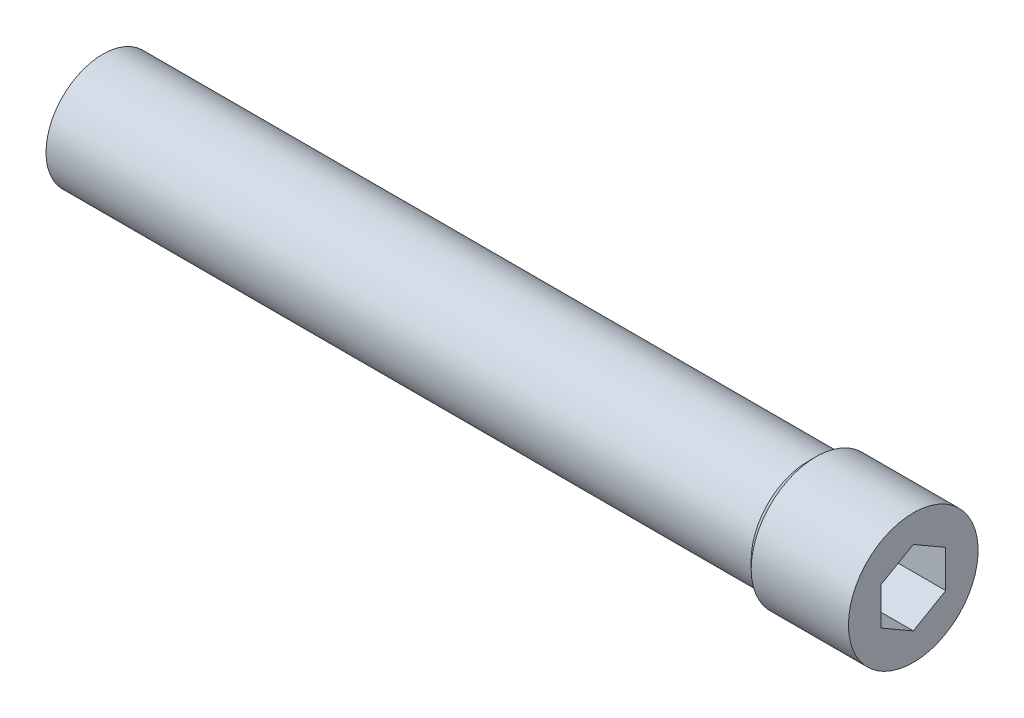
ISO-10303-21;
HEADER;
FILE_DESCRIPTION(('STEP AP214'),'2;1');
FILE_NAME('part.step','',(''),(''),'','','');
FILE_SCHEMA(('AUTOMOTIVE_DESIGN { 1 0 10303 214 1 1 1 1 }'));
ENDSEC;
DATA;
#1=APPLICATION_CONTEXT('core data for automotive mechanical design processes');
#2=APPLICATION_PROTOCOL_DEFINITION('international standard','automotive_design',2000,#1);
#3=PRODUCT_CONTEXT('',#1,'mechanical');
#4=PRODUCT('Part','Part','',(#3));
#5=PRODUCT_RELATED_PRODUCT_CATEGORY('part','',(#4));
#6=PRODUCT_DEFINITION_FORMATION('','',#4);
#7=PRODUCT_DEFINITION_CONTEXT('part definition',#1,'design');
#8=PRODUCT_DEFINITION('design','',#6,#7);
#9=PRODUCT_DEFINITION_SHAPE('','',#8);
#10=(LENGTH_UNIT() NAMED_UNIT(*) SI_UNIT(.MILLI.,.METRE.));
#11=(NAMED_UNIT(*) PLANE_ANGLE_UNIT() SI_UNIT($,.RADIAN.));
#12=(NAMED_UNIT(*) SI_UNIT($,.STERADIAN.) SOLID_ANGLE_UNIT());
#13=UNCERTAINTY_MEASURE_WITH_UNIT(LENGTH_MEASURE(1.E-05),#10,'distance_accuracy_value','');
#14=(GEOMETRIC_REPRESENTATION_CONTEXT(3) GLOBAL_UNCERTAINTY_ASSIGNED_CONTEXT((#13)) GLOBAL_UNIT_ASSIGNED_CONTEXT((#10,
#11,#12)) REPRESENTATION_CONTEXT('',''));
#15=CARTESIAN_POINT('',(0.,0.,0.));
#16=DIRECTION('',(0.,0.,1.));
#17=DIRECTION('',(1.,0.,0.));
#18=AXIS2_PLACEMENT_3D('',#15,#16,#17);
#19=CARTESIAN_POINT('',(0.,0.,0.));
#20=DIRECTION('',(1.,0.,0.));
#21=DIRECTION('',(0.,0.,-1.));
#22=AXIS2_PLACEMENT_3D('',#19,#20,#21);
#23=PLANE('',#22);
#24=CARTESIAN_POINT('',(0.,0.,0.));
#25=DIRECTION('',(-1.,0.,0.));
#26=DIRECTION('',(0.,0.,1.));
#27=AXIS2_PLACEMENT_3D('',#24,#25,#26);
#28=CIRCLE('',#27,7.);
#29=CARTESIAN_POINT('',(0.,0.,7.));
#30=VERTEX_POINT('',#29);
#31=EDGE_CURVE('E10',#30,#30,#28,.T.);
#32=ORIENTED_EDGE('',*,*,#31,.T.);
#33=EDGE_LOOP('',(#32));
#34=FACE_BOUND('',#33,.T.);
#35=ADVANCED_FACE('F16',(#34),#23,.F.);
#36=CARTESIAN_POINT('',(0.,0.,0.));
#37=DIRECTION('',(-1.,0.,0.));
#38=DIRECTION('',(0.,0.,1.));
#39=AXIS2_PLACEMENT_3D('',#36,#37,#38);
#40=CYLINDRICAL_SURFACE('',#39,7.);
#41=ORIENTED_EDGE('',*,*,#31,.F.);
#42=EDGE_LOOP('',(#41));
#43=FACE_BOUND('',#42,.T.);
#44=CARTESIAN_POINT('',(87.,0.,0.));
#45=DIRECTION('',(-1.,0.,0.));
#46=DIRECTION('',(0.,0.,1.));
#47=AXIS2_PLACEMENT_3D('',#44,#45,#46);
#48=CIRCLE('',#47,7.);
#49=CARTESIAN_POINT('',(87.,0.,7.));
#50=VERTEX_POINT('',#49);
#51=EDGE_CURVE('E23',#50,#50,#48,.T.);
#52=ORIENTED_EDGE('',*,*,#51,.T.);
#53=EDGE_LOOP('',(#52));
#54=FACE_BOUND('',#53,.T.);
#55=ADVANCED_FACE('F130',(#43,#54),#40,.T.);
#56=CARTESIAN_POINT('',(88.,0.,0.));
#57=DIRECTION('',(1.,0.,0.));
#58=DIRECTION('',(0.,0.,-1.));
#59=AXIS2_PLACEMENT_3D('',#56,#57,#58);
#60=CONICAL_SURFACE('',#59,8.,0.785398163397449);
#61=ORIENTED_EDGE('',*,*,#51,.F.);
#62=EDGE_LOOP('',(#61));
#63=FACE_BOUND('',#62,.T.);
#64=CARTESIAN_POINT('',(88.,0.,0.));
#65=DIRECTION('',(-1.,0.,0.));
#66=DIRECTION('',(0.,0.,1.));
#67=AXIS2_PLACEMENT_3D('',#64,#65,#66);
#68=CIRCLE('',#67,8.);
#69=CARTESIAN_POINT('',(88.,0.,8.));
#70=VERTEX_POINT('',#69);
#71=EDGE_CURVE('E125',#70,#70,#68,.T.);
#72=ORIENTED_EDGE('',*,*,#71,.T.);
#73=EDGE_LOOP('',(#72));
#74=FACE_BOUND('',#73,.T.);
#75=ADVANCED_FACE('F132',(#63,#74),#60,.T.);
#76=CARTESIAN_POINT('',(0.,0.,0.));
#77=DIRECTION('',(-1.,0.,0.));
#78=DIRECTION('',(0.,0.,1.));
#79=AXIS2_PLACEMENT_3D('',#76,#77,#78);
#80=CYLINDRICAL_SURFACE('',#79,8.);
#81=ORIENTED_EDGE('',*,*,#71,.F.);
#82=EDGE_LOOP('',(#81));
#83=FACE_BOUND('',#82,.T.);
#84=CARTESIAN_POINT('',(100.,0.,0.));
#85=DIRECTION('',(-1.,0.,0.));
#86=DIRECTION('',(0.,0.,1.));
#87=AXIS2_PLACEMENT_3D('',#84,#85,#86);
#88=CIRCLE('',#87,8.);
#89=CARTESIAN_POINT('',(100.,0.,8.));
#90=VERTEX_POINT('',#89);
#91=EDGE_CURVE('E117',#90,#90,#88,.T.);
#92=ORIENTED_EDGE('',*,*,#91,.T.);
#93=EDGE_LOOP('',(#92));
#94=FACE_BOUND('',#93,.T.);
#95=ADVANCED_FACE('F135',(#83,#94),#80,.T.);
#96=CARTESIAN_POINT('',(100.,8.,0.));
#97=DIRECTION('',(-1.,0.,0.));
#98=DIRECTION('',(0.,0.,1.));
#99=AXIS2_PLACEMENT_3D('',#96,#97,#98);
#100=PLANE('',#99);
#101=DIRECTION('',(0.,-0.5,0.866025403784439));
#102=VECTOR('',#101,1.);
#103=CARTESIAN_POINT('',(100.,4.61880215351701,0.));
#104=LINE('',#103,#102);
#105=CARTESIAN_POINT('',(100.,4.61880215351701,0.));
#106=VERTEX_POINT('',#105);
#107=CARTESIAN_POINT('',(100.,2.30940107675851,4.));
#108=VERTEX_POINT('',#107);
#109=EDGE_CURVE('E104',#106,#108,#104,.T.);
#110=ORIENTED_EDGE('',*,*,#109,.F.);
#111=DIRECTION('',(0.,0.5,0.866025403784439));
#112=VECTOR('',#111,1.);
#113=CARTESIAN_POINT('',(100.,2.30940107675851,-4.));
#114=LINE('',#113,#112);
#115=CARTESIAN_POINT('',(100.,2.30940107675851,-4.));
#116=VERTEX_POINT('',#115);
#117=EDGE_CURVE('E30',#116,#106,#114,.T.);
#118=ORIENTED_EDGE('',*,*,#117,.F.);
#119=DIRECTION('',(0.,1.,0.));
#120=VECTOR('',#119,1.);
#121=CARTESIAN_POINT('',(100.,-2.30940107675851,-4.));
#122=LINE('',#121,#120);
#123=CARTESIAN_POINT('',(100.,-2.30940107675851,-4.));
#124=VERTEX_POINT('',#123);
#125=EDGE_CURVE('E113',#124,#116,#122,.T.);
#126=ORIENTED_EDGE('',*,*,#125,.F.);
#127=DIRECTION('',(0.,0.5,-0.866025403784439));
#128=VECTOR('',#127,1.);
#129=CARTESIAN_POINT('',(100.,-4.61880215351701,0.));
#130=LINE('',#129,#128);
#131=CARTESIAN_POINT('',(100.,-4.61880215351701,0.));
#132=VERTEX_POINT('',#131);
#133=EDGE_CURVE('E111',#132,#124,#130,.T.);
#134=ORIENTED_EDGE('',*,*,#133,.F.);
#135=DIRECTION('',(0.,-0.5,-0.866025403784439));
#136=VECTOR('',#135,1.);
#137=CARTESIAN_POINT('',(100.,-2.30940107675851,4.));
#138=LINE('',#137,#136);
#139=CARTESIAN_POINT('',(100.,-2.30940107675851,4.));
#140=VERTEX_POINT('',#139);
#141=EDGE_CURVE('E78',#140,#132,#138,.T.);
#142=ORIENTED_EDGE('',*,*,#141,.F.);
#143=DIRECTION('',(0.,-1.,0.));
#144=VECTOR('',#143,1.);
#145=CARTESIAN_POINT('',(100.,2.30940107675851,4.));
#146=LINE('',#145,#144);
#147=EDGE_CURVE('E107',#108,#140,#146,.T.);
#148=ORIENTED_EDGE('',*,*,#147,.F.);
#149=EDGE_LOOP('',(#110,#118,#126,#134,#142,#148));
#150=FACE_BOUND('',#149,.T.);
#151=ORIENTED_EDGE('',*,*,#91,.F.);
#152=EDGE_LOOP('',(#151));
#153=FACE_BOUND('',#152,.T.);
#154=ADVANCED_FACE('F141',(#150,#153),#100,.F.);
#155=CARTESIAN_POINT('',(90.,2.30940107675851,-4.));
#156=DIRECTION('',(0.,0.866025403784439,-0.5));
#157=DIRECTION('',(0.,0.5,0.866025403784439));
#158=AXIS2_PLACEMENT_3D('',#155,#156,#157);
#159=PLANE('',#158);
#160=ORIENTED_EDGE('',*,*,#117,.T.);
#161=DIRECTION('',(1.,0.,0.));
#162=VECTOR('',#161,1.);
#163=CARTESIAN_POINT('',(90.,4.61880215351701,0.));
#164=LINE('',#163,#162);
#165=CARTESIAN_POINT('',(90.,4.61880215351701,0.));
#166=VERTEX_POINT('',#165);
#167=EDGE_CURVE('E60',#166,#106,#164,.T.);
#168=ORIENTED_EDGE('',*,*,#167,.F.);
#169=DIRECTION('',(0.,0.5,0.866025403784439));
#170=VECTOR('',#169,1.);
#171=CARTESIAN_POINT('',(90.,2.30940107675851,-4.));
#172=LINE('',#171,#170);
#173=CARTESIAN_POINT('',(90.,2.30940107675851,-4.));
#174=VERTEX_POINT('',#173);
#175=EDGE_CURVE('E115',#174,#166,#172,.T.);
#176=ORIENTED_EDGE('',*,*,#175,.F.);
#177=DIRECTION('',(1.,0.,0.));
#178=VECTOR('',#177,1.);
#179=CARTESIAN_POINT('',(90.,2.30940107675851,-4.));
#180=LINE('',#179,#178);
#181=EDGE_CURVE('E38',#174,#116,#180,.T.);
#182=ORIENTED_EDGE('',*,*,#181,.T.);
#183=EDGE_LOOP('',(#160,#168,#176,#182));
#184=FACE_BOUND('',#183,.T.);
#185=ADVANCED_FACE('F146',(#184),#159,.F.);
#186=CARTESIAN_POINT('',(90.,-2.30940107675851,-4.));
#187=DIRECTION('',(0.,0.,-1.));
#188=DIRECTION('',(-1.,0.,0.));
#189=AXIS2_PLACEMENT_3D('',#186,#187,#188);
#190=PLANE('',#189);
#191=ORIENTED_EDGE('',*,*,#125,.T.);
#192=ORIENTED_EDGE('',*,*,#181,.F.);
#193=DIRECTION('',(0.,1.,0.));
#194=VECTOR('',#193,1.);
#195=CARTESIAN_POINT('',(90.,-2.30940107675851,-4.));
#196=LINE('',#195,#194);
#197=CARTESIAN_POINT('',(90.,-2.30940107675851,-4.));
#198=VERTEX_POINT('',#197);
#199=EDGE_CURVE('E90',#198,#174,#196,.T.);
#200=ORIENTED_EDGE('',*,*,#199,.F.);
#201=DIRECTION('',(1.,0.,0.));
#202=VECTOR('',#201,1.);
#203=CARTESIAN_POINT('',(90.,-2.30940107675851,-4.));
#204=LINE('',#203,#202);
#205=EDGE_CURVE('E82',#198,#124,#204,.T.);
#206=ORIENTED_EDGE('',*,*,#205,.T.);
#207=EDGE_LOOP('',(#191,#192,#200,#206));
#208=FACE_BOUND('',#207,.T.);
#209=ADVANCED_FACE('F154',(#208),#190,.F.);
#210=CARTESIAN_POINT('',(90.,-4.61880215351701,0.));
#211=DIRECTION('',(0.,-0.866025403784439,-0.5));
#212=DIRECTION('',(0.,0.5,-0.866025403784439));
#213=AXIS2_PLACEMENT_3D('',#210,#211,#212);
#214=PLANE('',#213);
#215=ORIENTED_EDGE('',*,*,#133,.T.);
#216=ORIENTED_EDGE('',*,*,#205,.F.);
#217=DIRECTION('',(0.,0.5,-0.866025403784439));
#218=VECTOR('',#217,1.);
#219=CARTESIAN_POINT('',(90.,-4.61880215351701,0.));
#220=LINE('',#219,#218);
#221=CARTESIAN_POINT('',(90.,-4.61880215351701,0.));
#222=VERTEX_POINT('',#221);
#223=EDGE_CURVE('E86',#222,#198,#220,.T.);
#224=ORIENTED_EDGE('',*,*,#223,.F.);
#225=DIRECTION('',(1.,0.,0.));
#226=VECTOR('',#225,1.);
#227=CARTESIAN_POINT('',(90.,-4.61880215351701,0.));
#228=LINE('',#227,#226);
#229=EDGE_CURVE('E71',#222,#132,#228,.T.);
#230=ORIENTED_EDGE('',*,*,#229,.T.);
#231=EDGE_LOOP('',(#215,#216,#224,#230));
#232=FACE_BOUND('',#231,.T.);
#233=ADVANCED_FACE('F87',(#232),#214,.F.);
#234=CARTESIAN_POINT('',(90.,-2.30940107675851,4.));
#235=DIRECTION('',(0.,-0.866025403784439,0.5));
#236=DIRECTION('',(0.,-0.5,-0.866025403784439));
#237=AXIS2_PLACEMENT_3D('',#234,#235,#236);
#238=PLANE('',#237);
#239=ORIENTED_EDGE('',*,*,#141,.T.);
#240=ORIENTED_EDGE('',*,*,#229,.F.);
#241=DIRECTION('',(0.,-0.5,-0.866025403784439));
#242=VECTOR('',#241,1.);
#243=CARTESIAN_POINT('',(90.,-2.30940107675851,4.));
#244=LINE('',#243,#242);
#245=CARTESIAN_POINT('',(90.,-2.30940107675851,4.));
#246=VERTEX_POINT('',#245);
#247=EDGE_CURVE('E75',#246,#222,#244,.T.);
#248=ORIENTED_EDGE('',*,*,#247,.F.);
#249=DIRECTION('',(1.,0.,0.));
#250=VECTOR('',#249,1.);
#251=CARTESIAN_POINT('',(90.,-2.30940107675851,4.));
#252=LINE('',#251,#250);
#253=EDGE_CURVE('E83',#246,#140,#252,.T.);
#254=ORIENTED_EDGE('',*,*,#253,.T.);
#255=EDGE_LOOP('',(#239,#240,#248,#254));
#256=FACE_BOUND('',#255,.T.);
#257=ADVANCED_FACE('F73',(#256),#238,.F.);
#258=CARTESIAN_POINT('',(90.,2.30940107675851,4.));
#259=DIRECTION('',(0.,0.,1.));
#260=DIRECTION('',(1.,0.,0.));
#261=AXIS2_PLACEMENT_3D('',#258,#259,#260);
#262=PLANE('',#261);
#263=ORIENTED_EDGE('',*,*,#147,.T.);
#264=ORIENTED_EDGE('',*,*,#253,.F.);
#265=DIRECTION('',(0.,-1.,0.));
#266=VECTOR('',#265,1.);
#267=CARTESIAN_POINT('',(90.,2.30940107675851,4.));
#268=LINE('',#267,#266);
#269=CARTESIAN_POINT('',(90.,2.30940107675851,4.));
#270=VERTEX_POINT('',#269);
#271=EDGE_CURVE('E96',#270,#246,#268,.T.);
#272=ORIENTED_EDGE('',*,*,#271,.F.);
#273=DIRECTION('',(1.,0.,0.));
#274=VECTOR('',#273,1.);
#275=CARTESIAN_POINT('',(90.,2.30940107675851,4.));
#276=LINE('',#275,#274);
#277=EDGE_CURVE('E120',#270,#108,#276,.T.);
#278=ORIENTED_EDGE('',*,*,#277,.T.);
#279=EDGE_LOOP('',(#263,#264,#272,#278));
#280=FACE_BOUND('',#279,.T.);
#281=ADVANCED_FACE('F221',(#280),#262,.F.);
#282=CARTESIAN_POINT('',(90.,4.61880215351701,0.));
#283=DIRECTION('',(0.,0.866025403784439,0.5));
#284=DIRECTION('',(0.,-0.5,0.866025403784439));
#285=AXIS2_PLACEMENT_3D('',#282,#283,#284);
#286=PLANE('',#285);
#287=ORIENTED_EDGE('',*,*,#109,.T.);
#288=ORIENTED_EDGE('',*,*,#277,.F.);
#289=DIRECTION('',(0.,-0.5,0.866025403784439));
#290=VECTOR('',#289,1.);
#291=CARTESIAN_POINT('',(90.,4.61880215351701,0.));
#292=LINE('',#291,#290);
#293=EDGE_CURVE('E98',#166,#270,#292,.T.);
#294=ORIENTED_EDGE('',*,*,#293,.F.);
#295=ORIENTED_EDGE('',*,*,#167,.T.);
#296=EDGE_LOOP('',(#287,#288,#294,#295));
#297=FACE_BOUND('',#296,.T.);
#298=ADVANCED_FACE('F229',(#297),#286,.F.);
#299=CARTESIAN_POINT('',(90.,0.,0.));
#300=DIRECTION('',(1.,0.,0.));
#301=DIRECTION('',(0.,0.,-1.));
#302=AXIS2_PLACEMENT_3D('',#299,#300,#301);
#303=PLANE('',#302);
#304=ORIENTED_EDGE('',*,*,#175,.T.);
#305=ORIENTED_EDGE('',*,*,#293,.T.);
#306=ORIENTED_EDGE('',*,*,#271,.T.);
#307=ORIENTED_EDGE('',*,*,#247,.T.);
#308=ORIENTED_EDGE('',*,*,#223,.T.);
#309=ORIENTED_EDGE('',*,*,#199,.T.);
#310=EDGE_LOOP('',(#304,#305,#306,#307,#308,#309));
#311=FACE_BOUND('',#310,.T.);
#312=ADVANCED_FACE('F93',(#311),#303,.T.);
#313=CLOSED_SHELL('',(#35,#55,#75,#95,#154,#185,#209,#233,#257,#281,#298,#312));
#314=MANIFOLD_SOLID_BREP('B1',#313);
#315=ADVANCED_BREP_SHAPE_REPRESENTATION('',(#18,#314),#14);
#316=SHAPE_DEFINITION_REPRESENTATION(#9,#315);
ENDSEC;
END-ISO-10303-21;
